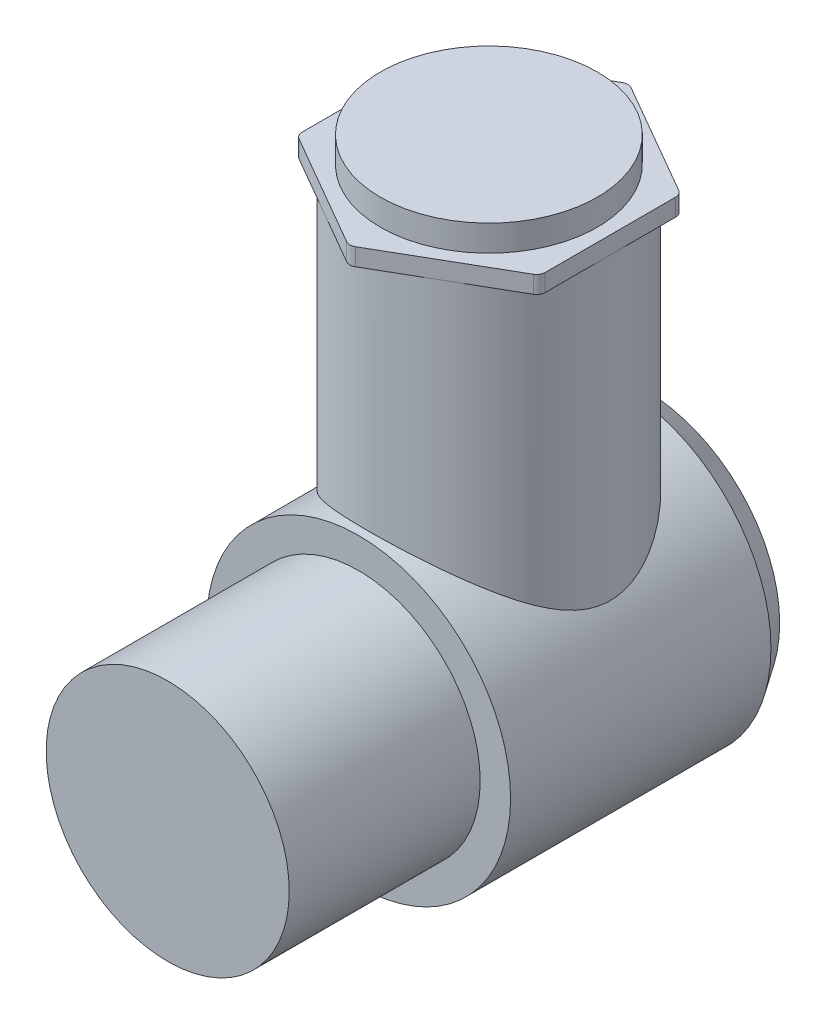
ISO-10303-21;
HEADER;
FILE_DESCRIPTION(('STEP AP214'),'2;1');
FILE_NAME('part.step','',(''),(''),'','','');
FILE_SCHEMA(('AUTOMOTIVE_DESIGN { 1 0 10303 214 1 1 1 1 }'));
ENDSEC;
DATA;
#1=APPLICATION_CONTEXT('core data for automotive mechanical design processes');
#2=APPLICATION_PROTOCOL_DEFINITION('international standard','automotive_design',2000,#1);
#3=PRODUCT_CONTEXT('',#1,'mechanical');
#4=PRODUCT('Part','Part','',(#3));
#5=PRODUCT_RELATED_PRODUCT_CATEGORY('part','',(#4));
#6=PRODUCT_DEFINITION_FORMATION('','',#4);
#7=PRODUCT_DEFINITION_CONTEXT('part definition',#1,'design');
#8=PRODUCT_DEFINITION('design','',#6,#7);
#9=PRODUCT_DEFINITION_SHAPE('','',#8);
#10=(LENGTH_UNIT() NAMED_UNIT(*) SI_UNIT(.MILLI.,.METRE.));
#11=(NAMED_UNIT(*) PLANE_ANGLE_UNIT() SI_UNIT($,.RADIAN.));
#12=(NAMED_UNIT(*) SI_UNIT($,.STERADIAN.) SOLID_ANGLE_UNIT());
#13=UNCERTAINTY_MEASURE_WITH_UNIT(LENGTH_MEASURE(1.E-05),#10,'distance_accuracy_value','');
#14=(GEOMETRIC_REPRESENTATION_CONTEXT(3) GLOBAL_UNCERTAINTY_ASSIGNED_CONTEXT((#13)) GLOBAL_UNIT_ASSIGNED_CONTEXT((#10,
#11,#12)) REPRESENTATION_CONTEXT('',''));
#15=CARTESIAN_POINT('',(0.,0.,0.));
#16=DIRECTION('',(0.,0.,1.));
#17=DIRECTION('',(1.,0.,0.));
#18=AXIS2_PLACEMENT_3D('',#15,#16,#17);
#19=CARTESIAN_POINT('',(0.,0.,150.));
#20=DIRECTION('',(0.,0.,-1.));
#21=DIRECTION('',(-1.,0.,0.));
#22=AXIS2_PLACEMENT_3D('',#19,#20,#21);
#23=CYLINDRICAL_SURFACE('',#22,175.);
#24=CARTESIAN_POINT('',(0.,0.,150.));
#25=DIRECTION('',(0.,0.,1.));
#26=DIRECTION('',(1.,0.,0.));
#27=AXIS2_PLACEMENT_3D('',#24,#25,#26);
#28=CIRCLE('',#27,175.);
#29=CARTESIAN_POINT('',(175.,0.,150.));
#30=VERTEX_POINT('',#29);
#31=EDGE_CURVE('E226',#30,#30,#28,.T.);
#32=ORIENTED_EDGE('',*,*,#31,.F.);
#33=EDGE_LOOP('',(#32));
#34=FACE_BOUND('',#33,.T.);
#35=CARTESIAN_POINT('',(0.,0.,-150.));
#36=DIRECTION('',(0.,0.,1.));
#37=DIRECTION('',(1.,0.,0.));
#38=AXIS2_PLACEMENT_3D('',#35,#36,#37);
#39=CIRCLE('',#38,175.);
#40=CARTESIAN_POINT('',(175.,0.,-150.));
#41=VERTEX_POINT('',#40);
#42=EDGE_CURVE('E199',#41,#41,#39,.T.);
#43=ORIENTED_EDGE('',*,*,#42,.T.);
#44=EDGE_LOOP('',(#43));
#45=FACE_BOUND('',#44,.T.);
#46=CARTESIAN_POINT('',(0.,175.,-140.));
#47=CARTESIAN_POINT('',(-1.68080300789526,174.999998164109,-139.999998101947));
#48=CARTESIAN_POINT('',(-3.36167422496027,174.975771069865,-139.969717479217));
#49=CARTESIAN_POINT('',(-6.72004292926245,174.878997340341,-139.848721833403));
#50=CARTESIAN_POINT('',(-8.39753991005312,174.806443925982,-139.757998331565));
#51=CARTESIAN_POINT('',(-11.7462356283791,174.61340139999,-139.51646936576));
#52=CARTESIAN_POINT('',(-13.4174310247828,174.492889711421,-139.365635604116));
#53=CARTESIAN_POINT('',(-16.7492251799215,174.204648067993,-139.004572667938));
#54=CARTESIAN_POINT('',(-18.4098243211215,174.036919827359,-138.794345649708));
#55=CARTESIAN_POINT('',(-21.7203796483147,173.654849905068,-138.314959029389));
#56=CARTESIAN_POINT('',(-23.3703092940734,173.440419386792,-138.04568710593));
#57=CARTESIAN_POINT('',(-26.6531920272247,172.966349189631,-137.449592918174));
#58=CARTESIAN_POINT('',(-28.2861449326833,172.706709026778,-137.122770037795));
#59=CARTESIAN_POINT('',(-31.53193351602,172.143689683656,-136.412963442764));
#60=CARTESIAN_POINT('',(-33.1447718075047,171.84031625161,-136.02998710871));
#61=CARTESIAN_POINT('',(-36.3478712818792,171.191420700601,-135.209339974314));
#62=CARTESIAN_POINT('',(-37.9381325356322,170.845898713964,-134.771669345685));
#63=CARTESIAN_POINT('',(-41.0834344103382,170.116844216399,-133.846260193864));
#64=CARTESIAN_POINT('',(-42.6386364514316,169.733572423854,-133.358864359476));
#65=CARTESIAN_POINT('',(-45.7223867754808,168.92898761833,-132.333306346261));
#66=CARTESIAN_POINT('',(-47.250932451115,168.507670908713,-131.79513923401));
#67=CARTESIAN_POINT('',(-50.2791715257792,167.62902571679,-130.669865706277));
#68=CARTESIAN_POINT('',(-51.7788679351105,167.171701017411,-130.082764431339));
#69=CARTESIAN_POINT('',(-54.7480602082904,166.222980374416,-128.861271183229));
#70=CARTESIAN_POINT('',(-56.2175534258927,165.731581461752,-128.226875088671));
#71=CARTESIAN_POINT('',(-59.1243339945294,164.71697581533,-126.912790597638));
#72=CARTESIAN_POINT('',(-60.561631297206,164.193779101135,-126.233116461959));
#73=CARTESIAN_POINT('',(-63.4034220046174,163.117487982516,-124.829954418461));
#74=CARTESIAN_POINT('',(-64.8079124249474,162.564390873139,-124.106462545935));
#75=CARTESIAN_POINT('',(-67.5830067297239,161.430430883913,-122.61735982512));
#76=CARTESIAN_POINT('',(-68.9536093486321,160.849566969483,-121.851747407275));
#77=CARTESIAN_POINT('',(-71.6600682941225,159.66220139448,-120.280021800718));
#78=CARTESIAN_POINT('',(-72.9959233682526,159.055698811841,-119.473907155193));
#79=CARTESIAN_POINT('',(-76.0913887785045,157.603787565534,-117.535094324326));
#80=CARTESIAN_POINT('',(-77.8365284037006,156.748747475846,-116.386443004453));
#81=CARTESIAN_POINT('',(-81.2611345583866,155.00104585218,-114.021746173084));
#82=CARTESIAN_POINT('',(-82.9405967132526,154.10838182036,-112.805696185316));
#83=CARTESIAN_POINT('',(-86.2333082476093,152.290361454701,-110.309049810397));
#84=CARTESIAN_POINT('',(-87.8465399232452,151.364996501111,-109.028436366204));
#85=CARTESIAN_POINT('',(-91.0056433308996,149.486954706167,-106.40576831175));
#86=CARTESIAN_POINT('',(-92.5515161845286,148.534278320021,-105.06371472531));
#87=CARTESIAN_POINT('',(-95.5794864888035,146.604207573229,-102.316915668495));
#88=CARTESIAN_POINT('',(-97.0614048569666,145.626754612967,-100.912014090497));
#89=CARTESIAN_POINT('',(-99.9567992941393,143.654816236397,-98.0448335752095));
#90=CARTESIAN_POINT('',(-101.370275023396,142.660330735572,-96.5825543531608));
#91=CARTESIAN_POINT('',(-104.128324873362,140.659851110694,-93.6024225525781));
#92=CARTESIAN_POINT('',(-105.472907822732,139.653858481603,-92.0845771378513));
#93=CARTESIAN_POINT('',(-108.093069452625,137.635833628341,-88.9943375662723));
#94=CARTESIAN_POINT('',(-109.368648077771,136.623801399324,-87.4219433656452));
#95=CARTESIAN_POINT('',(-111.869836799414,134.583745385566,-84.198375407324));
#96=CARTESIAN_POINT('',(-113.094352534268,133.555719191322,-82.5463538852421));
#97=CARTESIAN_POINT('',(-115.471235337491,131.506107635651,-79.1872914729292));
#98=CARTESIAN_POINT('',(-116.623601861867,130.484522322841,-77.4802501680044));
#99=CARTESIAN_POINT('',(-118.855725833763,128.454633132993,-74.0106281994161));
#100=CARTESIAN_POINT('',(-119.935458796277,127.446333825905,-72.2480290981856));
#101=CARTESIAN_POINT('',(-122.020717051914,125.451291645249,-68.6675802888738));
#102=CARTESIAN_POINT('',(-123.026243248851,124.464548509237,-66.8497312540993));
#103=CARTESIAN_POINT('',(-124.958865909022,122.52408614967,-63.1632898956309));
#104=CARTESIAN_POINT('',(-125.886169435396,121.570283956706,-61.2948500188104));
#105=CARTESIAN_POINT('',(-127.663361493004,119.702663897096,-57.5017634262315));
#106=CARTESIAN_POINT('',(-128.513246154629,118.788848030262,-55.5771139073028));
#107=CARTESIAN_POINT('',(-130.132278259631,117.012960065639,-51.6725606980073));
#108=CARTESIAN_POINT('',(-130.901482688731,116.150851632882,-49.6926972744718));
#109=CARTESIAN_POINT('',(-132.356330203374,114.490263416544,-45.676710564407));
#110=CARTESIAN_POINT('',(-133.04198830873,113.69177220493,-43.6405974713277));
#111=CARTESIAN_POINT('',(-134.422147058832,112.057997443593,-39.2028779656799));
#112=CARTESIAN_POINT('',(-135.10255475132,111.23515288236,-36.7922501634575));
#113=CARTESIAN_POINT('',(-136.340408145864,109.714429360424,-31.9006744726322));
#114=CARTESIAN_POINT('',(-136.897873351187,109.016530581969,-29.4197378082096));
#115=CARTESIAN_POINT('',(-137.635338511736,108.081775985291,-25.654366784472));
#116=CARTESIAN_POINT('',(-137.86453674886,107.789094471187,-24.3931132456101));
#117=CARTESIAN_POINT('',(-138.289361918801,107.243517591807,-21.8564732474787));
#118=CARTESIAN_POINT('',(-138.4849923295,106.990618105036,-20.5810882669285));
#119=CARTESIAN_POINT('',(-138.84176494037,106.5272258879,-18.0177420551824));
#120=CARTESIAN_POINT('',(-139.00290467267,106.316736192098,-16.7297799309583));
#121=CARTESIAN_POINT('',(-139.289832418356,105.940542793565,-14.1433877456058));
#122=CARTESIAN_POINT('',(-139.415620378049,105.774839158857,-12.8449576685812));
#123=CARTESIAN_POINT('',(-139.632092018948,105.4889159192,-10.2282810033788));
#124=CARTESIAN_POINT('',(-139.722450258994,105.369118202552,-8.90996117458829));
#125=CARTESIAN_POINT('',(-139.865885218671,105.178649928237,-6.26774170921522));
#126=CARTESIAN_POINT('',(-139.918961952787,105.107979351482,-4.94384207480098));
#127=CARTESIAN_POINT('',(-139.987491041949,105.016692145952,-2.2933930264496));
#128=CARTESIAN_POINT('',(-140.002944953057,104.996073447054,-0.966843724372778));
#129=CARTESIAN_POINT('',(-139.99613153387,105.005157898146,1.68598659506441));
#130=CARTESIAN_POINT('',(-139.973864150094,105.034861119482,3.01226761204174));
#131=CARTESIAN_POINT('',(-139.891724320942,105.144234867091,5.66254597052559));
#132=CARTESIAN_POINT('',(-139.83182491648,105.223941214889,6.98654099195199));
#133=CARTESIAN_POINT('',(-139.674780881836,105.432312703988,9.62843162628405));
#134=CARTESIAN_POINT('',(-139.577636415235,105.560977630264,10.9463272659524));
#135=CARTESIAN_POINT('',(-139.346685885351,105.86565841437,13.5735101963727));
#136=CARTESIAN_POINT('',(-139.212876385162,106.041678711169,14.882796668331));
#137=CARTESIAN_POINT('',(-138.909365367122,106.438952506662,17.4903193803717));
#138=CARTESIAN_POINT('',(-138.739662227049,106.660208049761,18.7885551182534));
#139=CARTESIAN_POINT('',(-138.335979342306,107.183405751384,21.5739331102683));
#140=CARTESIAN_POINT('',(-138.09609811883,107.492554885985,23.0588696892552));
#141=CARTESIAN_POINT('',(-137.571055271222,108.163700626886,26.0086403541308));
#142=CARTESIAN_POINT('',(-137.285891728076,108.525699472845,27.4734735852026));
#143=CARTESIAN_POINT('',(-136.671839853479,109.297993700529,30.3811831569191));
#144=CARTESIAN_POINT('',(-136.342947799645,109.708293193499,31.82405761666));
#145=CARTESIAN_POINT('',(-135.643011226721,110.572523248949,34.6863783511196));
#146=CARTESIAN_POINT('',(-135.271961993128,111.02645869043,36.1058219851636));
#147=CARTESIAN_POINT('',(-134.096026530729,112.448966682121,40.333948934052));
#148=CARTESIAN_POINT('',(-133.22970975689,113.476509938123,43.1060520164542));
#149=CARTESIAN_POINT('',(-131.344544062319,115.65328781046,48.5479943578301));
#150=CARTESIAN_POINT('',(-130.325682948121,116.802532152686,51.2178254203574));
#151=CARTESIAN_POINT('',(-128.42141115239,118.888175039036,55.7890107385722));
#152=CARTESIAN_POINT('',(-127.567981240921,119.804352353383,57.7130902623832));
#153=CARTESIAN_POINT('',(-125.783502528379,121.676548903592,61.505304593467));
#154=CARTESIAN_POINT('',(-124.852445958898,122.632572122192,63.3734337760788));
#155=CARTESIAN_POINT('',(-122.914525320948,124.574887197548,67.0548144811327));
#156=CARTESIAN_POINT('',(-121.907632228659,125.56119055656,68.8680446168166));
#157=CARTESIAN_POINT('',(-119.819938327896,127.554952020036,72.4393565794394));
#158=CARTESIAN_POINT('',(-118.739139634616,128.562409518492,74.1974399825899));
#159=CARTESIAN_POINT('',(-116.503454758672,130.591833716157,77.6607892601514));
#160=CARTESIAN_POINT('',(-115.348483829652,131.613815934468,79.3659912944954));
#161=CARTESIAN_POINT('',(-112.966394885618,133.663993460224,82.7213806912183));
#162=CARTESIAN_POINT('',(-111.739276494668,134.692188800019,84.3715677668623));
#163=CARTESIAN_POINT('',(-109.213677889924,136.748029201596,87.6161990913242));
#164=CARTESIAN_POINT('',(-107.91520968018,137.775674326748,89.2106526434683));
#165=CARTESIAN_POINT('',(-105.247124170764,139.824432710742,92.3432496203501));
#166=CARTESIAN_POINT('',(-103.877506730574,140.845545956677,93.8813929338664));
#167=CARTESIAN_POINT('',(-101.029751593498,142.902612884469,96.940562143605));
#168=CARTESIAN_POINT('',(-99.5496889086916,143.938230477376,98.4600235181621));
#169=CARTESIAN_POINT('',(-96.5151774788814,145.990326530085,101.436370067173));
#170=CARTESIAN_POINT('',(-94.9607282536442,147.006804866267,102.893254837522));
#171=CARTESIAN_POINT('',(-91.7775386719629,149.014849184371,105.742359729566));
#172=CARTESIAN_POINT('',(-90.1487848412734,150.006410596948,107.134568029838));
#173=CARTESIAN_POINT('',(-86.8178254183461,151.958519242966,109.851189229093));
#174=CARTESIAN_POINT('',(-85.1156216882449,152.919067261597,111.175603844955));
#175=CARTESIAN_POINT('',(-81.6424328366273,154.801181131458,113.75049796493));
#176=CARTESIAN_POINT('',(-79.8716114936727,155.722830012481,115.001137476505));
#177=CARTESIAN_POINT('',(-76.258671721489,157.523613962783,117.42806607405));
#178=CARTESIAN_POINT('',(-74.4165515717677,158.402748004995,118.604353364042));
#179=CARTESIAN_POINT('',(-70.6633639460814,160.112272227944,120.878042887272));
#180=CARTESIAN_POINT('',(-68.7523224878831,160.942680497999,121.975474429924));
#181=CARTESIAN_POINT('',(-64.8628910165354,162.549165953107,124.087474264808));
#182=CARTESIAN_POINT('',(-62.8845074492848,163.325248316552,125.102050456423));
#183=CARTESIAN_POINT('',(-59.4416008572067,164.602644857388,126.764452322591));
#184=CARTESIAN_POINT('',(-57.9929296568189,165.118790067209,127.433836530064));
#185=CARTESIAN_POINT('',(-55.0641143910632,166.118443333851,128.726474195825));
#186=CARTESIAN_POINT('',(-53.5839717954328,166.601952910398,129.349729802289));
#187=CARTESIAN_POINT('',(-50.5938587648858,167.534216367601,130.548287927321));
#188=CARTESIAN_POINT('',(-49.083892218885,167.982974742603,131.123596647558));
#189=CARTESIAN_POINT('',(-46.0356301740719,168.843800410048,132.224607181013));
#190=CARTESIAN_POINT('',(-44.4973343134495,169.255867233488,132.75030836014));
#191=CARTESIAN_POINT('',(-41.3952087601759,170.041157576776,133.750106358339));
#192=CARTESIAN_POINT('',(-39.8313929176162,170.41440140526,134.224230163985));
#193=CARTESIAN_POINT('',(-36.6796488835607,171.12045842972,135.119528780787));
#194=CARTESIAN_POINT('',(-35.0917207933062,171.453271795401,135.540703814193));
#195=CARTESIAN_POINT('',(-31.8941273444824,172.076779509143,136.328559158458));
#196=CARTESIAN_POINT('',(-30.2844610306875,172.367471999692,136.695237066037));
#197=CARTESIAN_POINT('',(-27.0461508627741,172.905175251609,137.372639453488));
#198=CARTESIAN_POINT('',(-25.4175069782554,173.152185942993,137.683363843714));
#199=CARTESIAN_POINT('',(-22.1354889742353,173.602356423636,138.249078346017));
#200=CARTESIAN_POINT('',(-20.4820295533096,173.805276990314,138.503764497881));
#201=CARTESIAN_POINT('',(-17.1620513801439,174.16443889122,138.954201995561));
#202=CARTESIAN_POINT('',(-15.495532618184,174.320680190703,139.149953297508));
#203=CARTESIAN_POINT('',(-12.1527672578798,174.585570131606,139.481652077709));
#204=CARTESIAN_POINT('',(-10.4765205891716,174.694218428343,139.617599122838));
#205=CARTESIAN_POINT('',(-7.11779098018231,174.863273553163,139.82906877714));
#206=CARTESIAN_POINT('',(-5.43530804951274,174.923680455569,139.904591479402));
#207=CARTESIAN_POINT('',(-2.06790525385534,174.995884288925,139.994857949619));
#208=CARTESIAN_POINT('',(-0.382985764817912,175.007688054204,140.0096102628));
#209=CARTESIAN_POINT('',(2.98593306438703,174.982632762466,139.978290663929));
#210=CARTESIAN_POINT('',(4.66993240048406,174.945773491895,139.932218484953));
#211=CARTESIAN_POINT('',(8.03332891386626,174.823617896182,139.779467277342));
#212=CARTESIAN_POINT('',(9.71272631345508,174.738323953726,139.672791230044));
#213=CARTESIAN_POINT('',(13.0634643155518,174.519811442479,139.399323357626));
#214=CARTESIAN_POINT('',(14.7348050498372,174.386593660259,139.232532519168));
#215=CARTESIAN_POINT('',(17.9307163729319,174.085761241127,138.855551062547));
#216=CARTESIAN_POINT('',(19.456182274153,173.921819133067,138.649985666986));
#217=CARTESIAN_POINT('',(22.4949334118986,173.554948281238,138.18950554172));
#218=CARTESIAN_POINT('',(24.0082186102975,173.35201941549,137.934590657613));
#219=CARTESIAN_POINT('',(27.0200742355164,172.908162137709,137.376348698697));
#220=CARTESIAN_POINT('',(28.518645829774,172.667236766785,137.073025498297));
#221=CARTESIAN_POINT('',(31.498964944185,172.148491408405,136.418997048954));
#222=CARTESIAN_POINT('',(32.9807123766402,171.870671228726,136.068291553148));
#223=CARTESIAN_POINT('',(35.9255061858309,171.279344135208,135.320604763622));
#224=CARTESIAN_POINT('',(37.3885498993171,170.965832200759,134.923616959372));
#225=CARTESIAN_POINT('',(40.2939365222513,170.304487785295,134.084619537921));
#226=CARTESIAN_POINT('',(41.7362778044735,169.956652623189,133.642606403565));
#227=CARTESIAN_POINT('',(44.598365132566,169.228148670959,132.714915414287));
#228=CARTESIAN_POINT('',(46.0181121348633,168.847481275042,132.229239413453));
#229=CARTESIAN_POINT('',(48.8336490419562,168.054794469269,131.21552406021));
#230=CARTESIAN_POINT('',(50.2294368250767,167.642772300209,130.687480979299));
#231=CARTESIAN_POINT('',(53.0808895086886,166.762646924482,129.556606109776));
#232=CARTESIAN_POINT('',(54.53493934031,166.292652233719,128.951170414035));
#233=CARTESIAN_POINT('',(57.4130042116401,165.32106571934,127.695781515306));
#234=CARTESIAN_POINT('',(58.8370165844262,164.819471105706,127.04582438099));
#235=CARTESIAN_POINT('',(63.061882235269,163.270307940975,125.031720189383));
#236=CARTESIAN_POINT('',(65.8161354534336,162.178182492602,123.603112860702));
#237=CARTESIAN_POINT('',(71.1910277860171,159.891743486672,120.587462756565));
#238=CARTESIAN_POINT('',(73.8116828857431,158.697442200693,119.000439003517));
#239=CARTESIAN_POINT('',(78.9151973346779,156.22238895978,115.679129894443));
#240=CARTESIAN_POINT('',(81.3980487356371,154.941632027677,113.944836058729));
#241=CARTESIAN_POINT('',(86.679082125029,152.060563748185,109.998021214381));
#242=CARTESIAN_POINT('',(89.4480661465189,150.445634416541,107.757096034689));
#243=CARTESIAN_POINT('',(94.7837127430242,147.142422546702,103.095107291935));
#244=CARTESIAN_POINT('',(97.3503521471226,145.454131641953,100.674023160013));
#245=CARTESIAN_POINT('',(101.04998778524,142.885144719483,96.9123528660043));
#246=CARTESIAN_POINT('',(102.259787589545,142.021447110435,95.6348447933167));
#247=CARTESIAN_POINT('',(104.627883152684,140.285994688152,93.0381307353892));
#248=CARTESIAN_POINT('',(105.786179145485,139.414239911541,91.7189249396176));
#249=CARTESIAN_POINT('',(108.051018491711,137.666349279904,89.039623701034));
#250=CARTESIAN_POINT('',(109.157561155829,136.790213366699,87.6795277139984));
#251=CARTESIAN_POINT('',(111.318646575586,135.037382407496,84.9189711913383));
#252=CARTESIAN_POINT('',(112.37318877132,134.160687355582,83.518510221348));
#253=CARTESIAN_POINT('',(114.649528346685,132.223938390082,80.3742176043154));
#254=CARTESIAN_POINT('',(115.858966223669,131.16469914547,78.6209125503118));
#255=CARTESIAN_POINT('',(118.199953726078,129.059092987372,75.0554421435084));
#256=CARTESIAN_POINT('',(119.331500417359,128.01272656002,73.2432745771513));
#257=CARTESIAN_POINT('',(121.516068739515,125.940907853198,69.5588557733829));
#258=CARTESIAN_POINT('',(122.569046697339,124.915467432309,67.686571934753));
#259=CARTESIAN_POINT('',(124.594080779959,122.895727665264,63.8823773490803));
#260=CARTESIAN_POINT('',(125.566138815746,121.901427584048,61.950468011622));
#261=CARTESIAN_POINT('',(127.423859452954,119.958161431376,58.0331176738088));
#262=CARTESIAN_POINT('',(128.309811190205,119.009049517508,56.0478865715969));
#263=CARTESIAN_POINT('',(129.996274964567,117.164543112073,52.0167508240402));
#264=CARTESIAN_POINT('',(130.79678110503,116.269152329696,49.9708420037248));
#265=CARTESIAN_POINT('',(132.307814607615,114.546730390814,45.8204505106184));
#266=CARTESIAN_POINT('',(133.01843406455,113.719629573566,43.7160305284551));
#267=CARTESIAN_POINT('',(134.345978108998,112.148188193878,39.4480909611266));
#268=CARTESIAN_POINT('',(134.962926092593,111.403826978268,37.2845862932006));
#269=CARTESIAN_POINT('',(136.141529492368,109.960982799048,32.7325797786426));
#270=CARTESIAN_POINT('',(136.695368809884,109.270339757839,30.3395098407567));
#271=CARTESIAN_POINT('',(137.434861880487,108.336587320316,26.7055796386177));
#272=CARTESIAN_POINT('',(137.666154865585,108.042363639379,25.4868400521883));
#273=CARTESIAN_POINT('',(138.097453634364,107.490539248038,23.035651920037));
#274=CARTESIAN_POINT('',(138.297462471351,107.232934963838,21.8032047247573));
#275=CARTESIAN_POINT('',(138.664944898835,106.757309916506,19.3285945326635));
#276=CARTESIAN_POINT('',(138.832485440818,106.539207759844,18.0864571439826));
#277=CARTESIAN_POINT('',(139.134734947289,106.144182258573,15.5917908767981));
#278=CARTESIAN_POINT('',(139.269447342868,105.967254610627,14.3392630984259));
#279=CARTESIAN_POINT('',(139.505369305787,105.656471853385,11.8256294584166));
#280=CARTESIAN_POINT('',(139.606576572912,105.522619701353,10.5645230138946));
#281=CARTESIAN_POINT('',(139.774914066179,105.299539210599,8.03608687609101));
#282=CARTESIAN_POINT('',(139.842044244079,105.210310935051,6.76875717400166));
#283=CARTESIAN_POINT('',(139.942109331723,105.077176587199,4.2233971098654));
#284=CARTESIAN_POINT('',(139.974855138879,105.033521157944,2.94534613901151));
#285=CARTESIAN_POINT('',(140.005301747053,104.992933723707,0.388083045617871));
#286=CARTESIAN_POINT('',(140.003002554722,104.996001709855,-0.891129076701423));
#287=CARTESIAN_POINT('',(139.963373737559,105.048822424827,-3.4480120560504));
#288=CARTESIAN_POINT('',(139.926044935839,105.098574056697,-4.72568294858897));
#289=CARTESIAN_POINT('',(139.816583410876,105.244150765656,-7.27689534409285));
#290=CARTESIAN_POINT('',(139.744450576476,105.339975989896,-8.5504368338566));
#291=CARTESIAN_POINT('',(139.56568201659,105.576713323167,-11.0926238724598));
#292=CARTESIAN_POINT('',(139.458999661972,105.717686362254,-12.3612604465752));
#293=CARTESIAN_POINT('',(139.211756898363,106.043049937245,-14.8896007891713));
#294=CARTESIAN_POINT('',(139.071196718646,106.227440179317,-16.1493046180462));
#295=CARTESIAN_POINT('',(138.756912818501,106.637638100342,-18.6579008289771));
#296=CARTESIAN_POINT('',(138.583185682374,106.863450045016,-19.90679208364));
#297=CARTESIAN_POINT('',(138.2034067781,107.354154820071,-22.3919340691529));
#298=CARTESIAN_POINT('',(137.997353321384,107.619049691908,-23.6281841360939));
#299=CARTESIAN_POINT('',(137.492993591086,108.263044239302,-26.4236469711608));
#300=CARTESIAN_POINT('',(137.184882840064,108.653544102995,-27.9784852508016));
#301=CARTESIAN_POINT('',(136.519551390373,109.488342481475,-31.0628789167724));
#302=CARTESIAN_POINT('',(136.162327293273,109.9326447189,-32.592432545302));
#303=CARTESIAN_POINT('',(135.019556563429,111.338112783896,-37.1415422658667));
#304=CARTESIAN_POINT('',(134.162920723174,112.371827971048,-40.1214965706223));
#305=CARTESIAN_POINT('',(132.745650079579,114.035635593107,-44.5080209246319));
#306=CARTESIAN_POINT('',(132.250446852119,114.609927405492,-45.9581167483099));
#307=CARTESIAN_POINT('',(131.217368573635,115.791266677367,-48.8295946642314));
#308=CARTESIAN_POINT('',(130.679494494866,116.398313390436,-50.2509774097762));
#309=CARTESIAN_POINT('',(129.562397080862,117.640482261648,-53.0648387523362));
#310=CARTESIAN_POINT('',(128.983173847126,118.275604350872,-54.4573174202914));
#311=CARTESIAN_POINT('',(127.784444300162,119.569703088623,-57.2135842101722));
#312=CARTESIAN_POINT('',(127.164936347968,120.228680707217,-58.577371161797));
#313=CARTESIAN_POINT('',(125.596376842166,121.870254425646,-61.8891323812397));
#314=CARTESIAN_POINT('',(124.625392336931,122.863960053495,-63.8212593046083));
#315=CARTESIAN_POINT('',(122.602486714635,124.882635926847,-67.6259765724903));
#316=CARTESIAN_POINT('',(121.550558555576,125.907608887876,-69.4985617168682));
#317=CARTESIAN_POINT('',(119.367109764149,127.979525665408,-73.1852744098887));
#318=CARTESIAN_POINT('',(118.235561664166,129.026476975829,-74.9993814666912));
#319=CARTESIAN_POINT('',(115.894449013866,131.133354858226,-78.5686428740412));
#320=CARTESIAN_POINT('',(114.684886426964,132.193281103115,-80.3237987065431));
#321=CARTESIAN_POINT('',(112.187372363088,134.319341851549,-83.7767137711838));
#322=CARTESIAN_POINT('',(110.899347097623,135.385481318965,-85.4744165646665));
#323=CARTESIAN_POINT('',(108.246531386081,137.515753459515,-88.8100748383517));
#324=CARTESIAN_POINT('',(106.881740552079,138.579886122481,-90.4480300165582));
#325=CARTESIAN_POINT('',(104.07602174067,140.699226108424,-93.6628673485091));
#326=CARTESIAN_POINT('',(102.635105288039,141.75443475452,-95.2397586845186));
#327=CARTESIAN_POINT('',(99.6772758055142,143.849662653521,-98.3311597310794));
#328=CARTESIAN_POINT('',(98.1603627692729,144.889681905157,-99.8456694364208));
#329=CARTESIAN_POINT('',(95.0302616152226,146.961964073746,-102.829892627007));
#330=CARTESIAN_POINT('',(93.4160640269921,147.993941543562,-104.298746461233));
#331=CARTESIAN_POINT('',(90.1104254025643,150.029593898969,-107.167628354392));
#332=CARTESIAN_POINT('',(88.4189839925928,151.033268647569,-108.567656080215));
#333=CARTESIAN_POINT('',(84.9591637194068,153.006231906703,-111.29597869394));
#334=CARTESIAN_POINT('',(83.1907693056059,153.975513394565,-112.624258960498));
#335=CARTESIAN_POINT('',(79.5783457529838,155.873183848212,-115.205096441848));
#336=CARTESIAN_POINT('',(77.7343173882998,156.801573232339,-116.457654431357));
#337=CARTESIAN_POINT('',(73.9764950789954,158.608999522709,-118.880037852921));
#338=CARTESIAN_POINT('',(72.062878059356,159.488148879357,-120.050053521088));
#339=CARTESIAN_POINT('',(68.1636053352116,161.193209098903,-122.306158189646));
#340=CARTESIAN_POINT('',(66.1779474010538,162.019118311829,-123.392244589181));
#341=CARTESIAN_POINT('',(62.1383276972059,163.61093795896,-125.475056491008));
#342=CARTESIAN_POINT('',(60.0844016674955,164.376879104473,-126.471827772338));
#343=CARTESIAN_POINT('',(55.9108094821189,165.842912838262,-128.371478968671));
#344=CARTESIAN_POINT('',(53.7911515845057,166.543013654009,-129.274370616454));
#345=CARTESIAN_POINT('',(50.1932664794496,167.654204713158,-130.702189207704));
#346=CARTESIAN_POINT('',(48.7317803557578,168.084977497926,-131.254212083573));
#347=CARTESIAN_POINT('',(45.7825203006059,168.912124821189,-132.311808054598));
#348=CARTESIAN_POINT('',(44.29474757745,169.308500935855,-132.817383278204));
#349=CARTESIAN_POINT('',(41.2947290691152,170.065100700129,-133.78051897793));
#350=CARTESIAN_POINT('',(39.7824842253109,170.425325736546,-134.23808129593));
#351=CARTESIAN_POINT('',(36.7354378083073,171.107992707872,-135.103723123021));
#352=CARTESIAN_POINT('',(35.2006360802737,171.430434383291,-135.511802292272));
#353=CARTESIAN_POINT('',(32.1141671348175,172.035309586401,-136.276198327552));
#354=CARTESIAN_POINT('',(30.5625454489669,172.317831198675,-136.632629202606));
#355=CARTESIAN_POINT('',(27.4414914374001,172.842322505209,-137.293513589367));
#356=CARTESIAN_POINT('',(25.8720594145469,173.084292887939,-137.597967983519));
#357=CARTESIAN_POINT('',(22.7185435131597,173.526372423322,-138.15364725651));
#358=CARTESIAN_POINT('',(21.1344651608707,173.726496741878,-138.404891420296));
#359=CARTESIAN_POINT('',(17.9540323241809,174.083924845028,-138.853272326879));
#360=CARTESIAN_POINT('',(16.3576793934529,174.241233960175,-139.050415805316));
#361=CARTESIAN_POINT('',(13.5343266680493,174.480162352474,-139.349679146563));
#362=CARTESIAN_POINT('',(12.3092898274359,174.570883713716,-139.463245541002));
#363=CARTESIAN_POINT('',(9.85529393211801,174.72659870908,-139.658110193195));
#364=CARTESIAN_POINT('',(8.6263358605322,174.791598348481,-139.739415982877));
#365=CARTESIAN_POINT('',(6.16534044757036,174.895699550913,-139.869608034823));
#366=CARTESIAN_POINT('',(4.93330250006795,174.934795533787,-139.918487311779));
#367=CARTESIAN_POINT('',(2.46752218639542,174.986949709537,-139.983688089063));
#368=CARTESIAN_POINT('',(1.2337794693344,175.00000134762,-140.00000139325));
#369=CARTESIAN_POINT('',(0.,175.,-140.));
#370=B_SPLINE_CURVE_WITH_KNOTS('',3,(#46,#47,#48,#49,#50,#51,#52,#53,#54,#55,#56,#57,#58,#59,
#60,#61,#62,#63,#64,#65,#66,#67,#68,#69,#70,#71,#72,#73,#74,#75,#76,#77,#78,#79,#80,#81,#82,#83,
#84,#85,#86,#87,#88,#89,#90,#91,#92,#93,#94,#95,#96,#97,#98,#99,#100,#101,#102,#103,#104,#105,
#106,#107,#108,#109,#110,#111,#112,#113,#114,#115,#116,#117,#118,#119,#120,#121,#122,#123,#124,
#125,#126,#127,#128,#129,#130,#131,#132,#133,#134,#135,#136,#137,#138,#139,#140,#141,#142,#143,
#144,#145,#146,#147,#148,#149,#150,#151,#152,#153,#154,#155,#156,#157,#158,#159,#160,#161,#162,
#163,#164,#165,#166,#167,#168,#169,#170,#171,#172,#173,#174,#175,#176,#177,#178,#179,#180,#181,
#182,#183,#184,#185,#186,#187,#188,#189,#190,#191,#192,#193,#194,#195,#196,#197,#198,#199,#200,
#201,#202,#203,#204,#205,#206,#207,#208,#209,#210,#211,#212,#213,#214,#215,#216,#217,#218,#219,
#220,#221,#222,#223,#224,#225,#226,#227,#228,#229,#230,#231,#232,#233,#234,#235,#236,#237,#238,
#239,#240,#241,#242,#243,#244,#245,#246,#247,#248,#249,#250,#251,#252,#253,#254,#255,#256,#257,
#258,#259,#260,#261,#262,#263,#264,#265,#266,#267,#268,#269,#270,#271,#272,#273,#274,#275,#276,
#277,#278,#279,#280,#281,#282,#283,#284,#285,#286,#287,#288,#289,#290,#291,#292,#293,#294,#295,
#296,#297,#298,#299,#300,#301,#302,#303,#304,#305,#306,#307,#308,#309,#310,#311,#312,#313,#314,
#315,#316,#317,#318,#319,#320,#321,#322,#323,#324,#325,#326,#327,#328,#329,#330,#331,#332,#333,
#334,#335,#336,#337,#338,#339,#340,#341,#342,#343,#344,#345,#346,#347,#348,#349,#350,#351,#352,
#353,#354,#355,#356,#357,#358,#359,#360,#361,#362,#363,#364,#365,#366,#367,#368,#369),
.UNSPECIFIED.,.T.,.F.,(4,2,2,2,2,2,2,2,2,2,2,2,2,2,2,2,2,2,2,2,2,2,2,2,2,2,2,2,2,2,2,2,2,2,2,2,
2,2,2,2,2,2,2,2,2,2,2,2,2,2,2,2,2,2,2,2,2,2,2,2,2,2,2,2,2,2,2,2,2,2,2,2,2,2,2,2,2,2,2,2,2,2,2,2,
2,2,2,2,2,2,2,2,2,2,2,2,2,2,2,2,2,2,2,2,2,2,2,2,2,2,2,2,2,2,2,2,2,2,2,2,2,2,2,2,2,2,2,2,2,2,2,2,
2,2,2,2,2,2,2,2,2,2,2,2,2,2,2,2,2,2,2,2,2,2,2,2,2,2,2,2,2,4),(0.,5.04208097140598,
10.0848693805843,15.1300345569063,20.1750165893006,25.2296802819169,30.2843980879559,
35.3384521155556,40.3924902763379,45.4137899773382,50.4355780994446,55.4568393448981,
60.4785386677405,65.4986637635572,70.5192437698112,75.5400109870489,80.5609589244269,
87.3307845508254,94.1010603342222,100.873134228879,107.645095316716,114.434928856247,
121.224796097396,128.013791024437,134.802791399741,141.698034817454,148.593330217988,
155.490938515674,162.388462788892,169.26711482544,176.146110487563,183.020214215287,
189.89308029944,197.796597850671,205.698860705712,209.642636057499,213.586002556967,
217.52965111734,221.473305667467,225.452380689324,229.431454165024,233.41036306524,
237.389277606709,241.37104584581,245.352796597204,249.334920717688,253.317224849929,
257.922261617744,262.527493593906,267.133117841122,271.739257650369,280.971710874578,
290.204902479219,297.08939751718,303.974582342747,310.862415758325,317.750052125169,
324.645703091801,331.541389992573,338.435920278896,345.330464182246,352.409852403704,
359.489286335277,366.57000917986,373.650552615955,380.715127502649,387.779872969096,
394.841978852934,401.903410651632,406.933990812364,411.964336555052,416.994030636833,
422.023789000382,427.050902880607,432.077995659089,437.105310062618,442.132632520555,
447.186586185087,452.240543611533,457.294537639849,462.348523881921,467.401799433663,
472.455097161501,477.508146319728,482.561112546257,487.203675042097,491.846252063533,
496.48845769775,501.130687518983,505.773571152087,510.41681774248,515.059867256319,
519.703325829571,524.6331153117,529.563340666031,539.421875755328,549.279228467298,
559.137149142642,570.859884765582,582.58396084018,588.463044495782,594.342101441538,
600.221236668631,606.100435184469,613.234844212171,620.369521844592,627.508136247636,
634.646582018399,641.760163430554,648.874235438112,655.980958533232,663.085903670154,
670.733222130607,674.557140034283,678.38068449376,682.196258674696,686.011433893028,
689.826870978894,693.642313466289,697.478631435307,701.314948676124,705.151175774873,
708.987415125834,712.828853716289,716.670266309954,720.51207472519,724.354083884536,
729.249383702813,734.145022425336,743.936457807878,748.844895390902,753.753221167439,
758.661534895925,763.570048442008,770.70680256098,777.844178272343,784.984028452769,
792.123699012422,799.270190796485,806.416718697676,813.562167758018,820.707617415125,
827.947761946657,835.187941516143,842.429591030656,849.671166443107,856.895466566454,
864.119990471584,871.340789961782,878.560685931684,883.421266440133,888.281624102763,
893.141795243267,898.00199976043,902.851306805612,907.70053151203,912.547995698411,
917.394856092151,921.095090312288,924.794460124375,928.494626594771,932.195724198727),.UNSPECIFIED.);
#371=CARTESIAN_POINT('',(0.,175.,-140.));
#372=VERTEX_POINT('',#371);
#373=EDGE_CURVE('E231',#372,#372,#370,.T.);
#374=ORIENTED_EDGE('',*,*,#373,.F.);
#375=EDGE_LOOP('',(#374));
#376=FACE_BOUND('',#375,.T.);
#377=ADVANCED_FACE('F47',(#34,#45,#376),#23,.T.);
#378=CARTESIAN_POINT('',(0.,0.,150.));
#379=DIRECTION('',(0.,0.,1.));
#380=DIRECTION('',(1.,0.,0.));
#381=AXIS2_PLACEMENT_3D('',#378,#379,#380);
#382=PLANE('',#381);
#383=CARTESIAN_POINT('',(0.,0.,150.));
#384=DIRECTION('',(0.,0.,1.));
#385=DIRECTION('',(1.,0.,0.));
#386=AXIS2_PLACEMENT_3D('',#383,#384,#385);
#387=CIRCLE('',#386,140.);
#388=CARTESIAN_POINT('',(140.,0.,150.));
#389=VERTEX_POINT('',#388);
#390=EDGE_CURVE('E227',#389,#389,#387,.T.);
#391=ORIENTED_EDGE('',*,*,#390,.F.);
#392=EDGE_LOOP('',(#391));
#393=FACE_BOUND('',#392,.T.);
#394=ORIENTED_EDGE('',*,*,#31,.T.);
#395=EDGE_LOOP('',(#394));
#396=FACE_BOUND('',#395,.T.);
#397=ADVANCED_FACE('F260',(#393,#396),#382,.T.);
#398=CARTESIAN_POINT('',(0.,0.,370.));
#399=DIRECTION('',(0.,0.,-1.));
#400=DIRECTION('',(-1.,0.,0.));
#401=AXIS2_PLACEMENT_3D('',#398,#399,#400);
#402=CYLINDRICAL_SURFACE('',#401,140.);
#403=CARTESIAN_POINT('',(0.,0.,370.));
#404=DIRECTION('',(0.,0.,1.));
#405=DIRECTION('',(1.,0.,0.));
#406=AXIS2_PLACEMENT_3D('',#403,#404,#405);
#407=CIRCLE('',#406,140.);
#408=CARTESIAN_POINT('',(140.,0.,370.));
#409=VERTEX_POINT('',#408);
#410=EDGE_CURVE('E185',#409,#409,#407,.T.);
#411=ORIENTED_EDGE('',*,*,#410,.F.);
#412=EDGE_LOOP('',(#411));
#413=FACE_BOUND('',#412,.T.);
#414=ORIENTED_EDGE('',*,*,#390,.T.);
#415=EDGE_LOOP('',(#414));
#416=FACE_BOUND('',#415,.T.);
#417=ADVANCED_FACE('F257',(#413,#416),#402,.T.);
#418=CARTESIAN_POINT('',(0.,0.,370.));
#419=DIRECTION('',(0.,0.,1.));
#420=DIRECTION('',(1.,0.,0.));
#421=AXIS2_PLACEMENT_3D('',#418,#419,#420);
#422=PLANE('',#421);
#423=ORIENTED_EDGE('',*,*,#410,.T.);
#424=EDGE_LOOP('',(#423));
#425=FACE_BOUND('',#424,.T.);
#426=ADVANCED_FACE('F253',(#425),#422,.T.);
#427=CARTESIAN_POINT('',(0.,450.,0.));
#428=DIRECTION('',(0.,-1.,0.));
#429=DIRECTION('',(0.,0.,-1.));
#430=AXIS2_PLACEMENT_3D('',#427,#428,#429);
#431=CYLINDRICAL_SURFACE('',#430,140.);
#432=CARTESIAN_POINT('',(0.,450.,0.));
#433=DIRECTION('',(0.,1.,0.));
#434=DIRECTION('',(0.,0.,1.));
#435=AXIS2_PLACEMENT_3D('',#432,#433,#434);
#436=CIRCLE('',#435,140.);
#437=CARTESIAN_POINT('',(70.,450.,121.243556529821));
#438=VERTEX_POINT('',#437);
#439=CARTESIAN_POINT('',(140.,450.,0.));
#440=VERTEX_POINT('',#439);
#441=EDGE_CURVE('E173',#438,#440,#436,.T.);
#442=ORIENTED_EDGE('',*,*,#441,.F.);
#443=CARTESIAN_POINT('',(-70.,450.,121.243556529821));
#444=VERTEX_POINT('',#443);
#445=EDGE_CURVE('E177',#444,#438,#436,.T.);
#446=ORIENTED_EDGE('',*,*,#445,.F.);
#447=CARTESIAN_POINT('',(-140.,450.,0.));
#448=VERTEX_POINT('',#447);
#449=EDGE_CURVE('E192',#448,#444,#436,.T.);
#450=ORIENTED_EDGE('',*,*,#449,.F.);
#451=CARTESIAN_POINT('',(-70.,450.,-121.243556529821));
#452=VERTEX_POINT('',#451);
#453=EDGE_CURVE('E495',#452,#448,#436,.T.);
#454=ORIENTED_EDGE('',*,*,#453,.F.);
#455=CARTESIAN_POINT('',(70.,450.,-121.243556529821));
#456=VERTEX_POINT('',#455);
#457=EDGE_CURVE('E497',#456,#452,#436,.T.);
#458=ORIENTED_EDGE('',*,*,#457,.F.);
#459=EDGE_CURVE('E181',#440,#456,#436,.T.);
#460=ORIENTED_EDGE('',*,*,#459,.F.);
#461=EDGE_LOOP('',(#442,#446,#450,#454,#458,#460));
#462=FACE_BOUND('',#461,.T.);
#463=ORIENTED_EDGE('',*,*,#373,.T.);
#464=EDGE_LOOP('',(#463));
#465=FACE_BOUND('',#464,.T.);
#466=ADVANCED_FACE('F174',(#462,#465),#431,.T.);
#467=CARTESIAN_POINT('',(0.,450.,0.));
#468=DIRECTION('',(0.,1.,0.));
#469=DIRECTION('',(0.,0.,1.));
#470=AXIS2_PLACEMENT_3D('',#467,#468,#469);
#471=PLANE('',#470);
#472=DIRECTION('',(0.,0.,-1.));
#473=VECTOR('',#472,1.);
#474=CARTESIAN_POINT('',(140.,450.,80.8290376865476));
#475=LINE('',#474,#473);
#476=CARTESIAN_POINT('',(140.,450.,75.0555349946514));
#477=VERTEX_POINT('',#476);
#478=EDGE_CURVE('E204',#477,#440,#475,.T.);
#479=ORIENTED_EDGE('',*,*,#478,.F.);
#480=CARTESIAN_POINT('',(130.,450.,75.0555349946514));
#481=DIRECTION('',(0.,1.,0.));
#482=DIRECTION('',(0.,0.,1.));
#483=AXIS2_PLACEMENT_3D('',#480,#481,#482);
#484=CIRCLE('',#483,10.);
#485=CARTESIAN_POINT('',(135.,450.,83.7157890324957));
#486=VERTEX_POINT('',#485);
#487=EDGE_CURVE('E56',#477,#486,#484,.F.);
#488=ORIENTED_EDGE('',*,*,#487,.T.);
#489=DIRECTION('',(0.866025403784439,0.,-0.5));
#490=VECTOR('',#489,1.);
#491=CARTESIAN_POINT('',(0.,450.,161.658075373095));
#492=LINE('',#491,#490);
#493=EDGE_CURVE('E161',#438,#486,#492,.T.);
#494=ORIENTED_EDGE('',*,*,#493,.F.);
#495=ORIENTED_EDGE('',*,*,#441,.T.);
#496=EDGE_LOOP('',(#479,#488,#494,#495));
#497=FACE_BOUND('',#496,.T.);
#498=ADVANCED_FACE('F194',(#497),#471,.F.);
#499=DIRECTION('',(-0.866025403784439,0.,-0.5));
#500=VECTOR('',#499,1.);
#501=CARTESIAN_POINT('',(140.,450.,-80.8290376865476));
#502=LINE('',#501,#500);
#503=CARTESIAN_POINT('',(135.,450.,-83.7157890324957));
#504=VERTEX_POINT('',#503);
#505=EDGE_CURVE('E208',#504,#456,#502,.T.);
#506=ORIENTED_EDGE('',*,*,#505,.F.);
#507=CARTESIAN_POINT('',(130.,450.,-75.0555349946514));
#508=DIRECTION('',(0.,1.,0.));
#509=DIRECTION('',(0.,0.,1.));
#510=AXIS2_PLACEMENT_3D('',#507,#508,#509);
#511=CIRCLE('',#510,10.);
#512=CARTESIAN_POINT('',(140.,450.,-75.0555349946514));
#513=VERTEX_POINT('',#512);
#514=EDGE_CURVE('E70',#504,#513,#511,.F.);
#515=ORIENTED_EDGE('',*,*,#514,.T.);
#516=EDGE_CURVE('E167',#440,#513,#475,.T.);
#517=ORIENTED_EDGE('',*,*,#516,.F.);
#518=ORIENTED_EDGE('',*,*,#459,.T.);
#519=EDGE_LOOP('',(#506,#515,#517,#518));
#520=FACE_BOUND('',#519,.T.);
#521=ADVANCED_FACE('F437',(#520),#471,.F.);
#522=DIRECTION('',(-0.866025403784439,0.,0.5));
#523=VECTOR('',#522,1.);
#524=CARTESIAN_POINT('',(0.,450.,-161.658075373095));
#525=LINE('',#524,#523);
#526=CARTESIAN_POINT('',(-4.99999999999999,450.,-158.771324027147));
#527=VERTEX_POINT('',#526);
#528=EDGE_CURVE('E212',#527,#452,#525,.T.);
#529=ORIENTED_EDGE('',*,*,#528,.F.);
#530=CARTESIAN_POINT('',(0.,450.,-150.111069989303));
#531=DIRECTION('',(0.,1.,0.));
#532=DIRECTION('',(0.,0.,1.));
#533=AXIS2_PLACEMENT_3D('',#530,#531,#532);
#534=CIRCLE('',#533,10.);
#535=CARTESIAN_POINT('',(4.99999999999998,450.,-158.771324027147));
#536=VERTEX_POINT('',#535);
#537=EDGE_CURVE('E345',#527,#536,#534,.F.);
#538=ORIENTED_EDGE('',*,*,#537,.T.);
#539=EDGE_CURVE('E207',#456,#536,#502,.T.);
#540=ORIENTED_EDGE('',*,*,#539,.F.);
#541=ORIENTED_EDGE('',*,*,#457,.T.);
#542=EDGE_LOOP('',(#529,#538,#540,#541));
#543=FACE_BOUND('',#542,.T.);
#544=ADVANCED_FACE('F467',(#543),#471,.F.);
#545=DIRECTION('',(0.,0.,1.));
#546=VECTOR('',#545,1.);
#547=CARTESIAN_POINT('',(-140.,450.,-80.8290376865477));
#548=LINE('',#547,#546);
#549=CARTESIAN_POINT('',(-140.,450.,-75.0555349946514));
#550=VERTEX_POINT('',#549);
#551=EDGE_CURVE('E216',#550,#448,#548,.T.);
#552=ORIENTED_EDGE('',*,*,#551,.F.);
#553=CARTESIAN_POINT('',(-130.,450.,-75.0555349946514));
#554=DIRECTION('',(0.,1.,0.));
#555=DIRECTION('',(0.,0.,1.));
#556=AXIS2_PLACEMENT_3D('',#553,#554,#555);
#557=CIRCLE('',#556,10.);
#558=CARTESIAN_POINT('',(-135.,450.,-83.7157890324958));
#559=VERTEX_POINT('',#558);
#560=EDGE_CURVE('E12',#550,#559,#557,.F.);
#561=ORIENTED_EDGE('',*,*,#560,.T.);
#562=EDGE_CURVE('E211',#452,#559,#525,.T.);
#563=ORIENTED_EDGE('',*,*,#562,.F.);
#564=ORIENTED_EDGE('',*,*,#453,.T.);
#565=EDGE_LOOP('',(#552,#561,#563,#564));
#566=FACE_BOUND('',#565,.T.);
#567=ADVANCED_FACE('F462',(#566),#471,.F.);
#568=DIRECTION('',(0.866025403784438,0.,0.5));
#569=VECTOR('',#568,1.);
#570=CARTESIAN_POINT('',(-140.,450.,80.8290376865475));
#571=LINE('',#570,#569);
#572=CARTESIAN_POINT('',(-135.,450.,83.7157890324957));
#573=VERTEX_POINT('',#572);
#574=EDGE_CURVE('E219',#573,#444,#571,.T.);
#575=ORIENTED_EDGE('',*,*,#574,.F.);
#576=CARTESIAN_POINT('',(-130.,450.,75.0555349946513));
#577=DIRECTION('',(0.,1.,0.));
#578=DIRECTION('',(0.,0.,1.));
#579=AXIS2_PLACEMENT_3D('',#576,#577,#578);
#580=CIRCLE('',#579,10.);
#581=CARTESIAN_POINT('',(-140.,450.,75.0555349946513));
#582=VERTEX_POINT('',#581);
#583=EDGE_CURVE('E322',#573,#582,#580,.F.);
#584=ORIENTED_EDGE('',*,*,#583,.T.);
#585=EDGE_CURVE('E215',#448,#582,#548,.T.);
#586=ORIENTED_EDGE('',*,*,#585,.F.);
#587=ORIENTED_EDGE('',*,*,#449,.T.);
#588=EDGE_LOOP('',(#575,#584,#586,#587));
#589=FACE_BOUND('',#588,.T.);
#590=ADVANCED_FACE('F458',(#589),#471,.F.);
#591=CARTESIAN_POINT('',(4.99999999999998,450.,158.771324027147));
#592=VERTEX_POINT('',#591);
#593=EDGE_CURVE('E156',#592,#438,#492,.T.);
#594=ORIENTED_EDGE('',*,*,#593,.F.);
#595=CARTESIAN_POINT('',(0.,450.,150.111069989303));
#596=DIRECTION('',(0.,1.,0.));
#597=DIRECTION('',(0.,0.,1.));
#598=AXIS2_PLACEMENT_3D('',#595,#596,#597);
#599=CIRCLE('',#598,10.);
#600=CARTESIAN_POINT('',(-5.00000000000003,450.,158.771324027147));
#601=VERTEX_POINT('',#600);
#602=EDGE_CURVE('E389',#592,#601,#599,.F.);
#603=ORIENTED_EDGE('',*,*,#602,.T.);
#604=EDGE_CURVE('E190',#444,#601,#571,.T.);
#605=ORIENTED_EDGE('',*,*,#604,.F.);
#606=ORIENTED_EDGE('',*,*,#445,.T.);
#607=EDGE_LOOP('',(#594,#603,#605,#606));
#608=FACE_BOUND('',#607,.T.);
#609=ADVANCED_FACE('F188',(#608),#471,.F.);
#610=CARTESIAN_POINT('',(0.,470.,161.658075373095));
#611=DIRECTION('',(-0.5,0.,-0.866025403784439));
#612=DIRECTION('',(-0.866025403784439,0.,0.5));
#613=AXIS2_PLACEMENT_3D('',#610,#611,#612);
#614=PLANE('',#613);
#615=DIRECTION('',(0.866025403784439,0.,-0.5));
#616=VECTOR('',#615,1.);
#617=CARTESIAN_POINT('',(0.,470.,161.658075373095));
#618=LINE('',#617,#616);
#619=CARTESIAN_POINT('',(4.99999999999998,470.,158.771324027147));
#620=VERTEX_POINT('',#619);
#621=CARTESIAN_POINT('',(135.,470.,83.7157890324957));
#622=VERTEX_POINT('',#621);
#623=EDGE_CURVE('E221',#620,#622,#618,.T.);
#624=ORIENTED_EDGE('',*,*,#623,.F.);
#625=DIRECTION('',(0.,-1.,0.));
#626=VECTOR('',#625,1.);
#627=CARTESIAN_POINT('',(4.99999999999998,470.,158.771324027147));
#628=LINE('',#627,#626);
#629=EDGE_CURVE('E163',#620,#592,#628,.T.);
#630=ORIENTED_EDGE('',*,*,#629,.T.);
#631=ORIENTED_EDGE('',*,*,#593,.T.);
#632=ORIENTED_EDGE('',*,*,#493,.T.);
#633=DIRECTION('',(0.,-1.,0.));
#634=VECTOR('',#633,1.);
#635=CARTESIAN_POINT('',(135.,470.,83.7157890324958));
#636=LINE('',#635,#634);
#637=EDGE_CURVE('E244',#486,#622,#636,.F.);
#638=ORIENTED_EDGE('',*,*,#637,.T.);
#639=EDGE_LOOP('',(#624,#630,#631,#632,#638));
#640=FACE_BOUND('',#639,.T.);
#641=ADVANCED_FACE('F159',(#640),#614,.F.);
#642=CARTESIAN_POINT('',(140.,470.,80.8290376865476));
#643=DIRECTION('',(-1.,0.,0.));
#644=DIRECTION('',(0.,0.,1.));
#645=AXIS2_PLACEMENT_3D('',#642,#643,#644);
#646=PLANE('',#645);
#647=ORIENTED_EDGE('',*,*,#516,.T.);
#648=DIRECTION('',(0.,-1.,0.));
#649=VECTOR('',#648,1.);
#650=CARTESIAN_POINT('',(140.,470.,-75.0555349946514));
#651=LINE('',#650,#649);
#652=CARTESIAN_POINT('',(140.,470.,-75.0555349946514));
#653=VERTEX_POINT('',#652);
#654=EDGE_CURVE('E360',#513,#653,#651,.F.);
#655=ORIENTED_EDGE('',*,*,#654,.T.);
#656=DIRECTION('',(0.,0.,-1.));
#657=VECTOR('',#656,1.);
#658=CARTESIAN_POINT('',(140.,470.,80.8290376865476));
#659=LINE('',#658,#657);
#660=CARTESIAN_POINT('',(140.,470.,75.0555349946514));
#661=VERTEX_POINT('',#660);
#662=EDGE_CURVE('E290',#661,#653,#659,.T.);
#663=ORIENTED_EDGE('',*,*,#662,.F.);
#664=DIRECTION('',(0.,-1.,0.));
#665=VECTOR('',#664,1.);
#666=CARTESIAN_POINT('',(140.,470.,75.0555349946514));
#667=LINE('',#666,#665);
#668=EDGE_CURVE('E357',#661,#477,#667,.T.);
#669=ORIENTED_EDGE('',*,*,#668,.T.);
#670=ORIENTED_EDGE('',*,*,#478,.T.);
#671=EDGE_LOOP('',(#647,#655,#663,#669,#670));
#672=FACE_BOUND('',#671,.T.);
#673=ADVANCED_FACE('F366',(#672),#646,.F.);
#674=CARTESIAN_POINT('',(140.,470.,-80.8290376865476));
#675=DIRECTION('',(-0.5,0.,0.866025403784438));
#676=DIRECTION('',(0.866025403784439,0.,0.5));
#677=AXIS2_PLACEMENT_3D('',#674,#675,#676);
#678=PLANE('',#677);
#679=ORIENTED_EDGE('',*,*,#539,.T.);
#680=DIRECTION('',(0.,-1.,0.));
#681=VECTOR('',#680,1.);
#682=CARTESIAN_POINT('',(5.00000000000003,470.,-158.771324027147));
#683=LINE('',#682,#681);
#684=CARTESIAN_POINT('',(4.99999999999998,470.,-158.771324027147));
#685=VERTEX_POINT('',#684);
#686=EDGE_CURVE('E352',#536,#685,#683,.F.);
#687=ORIENTED_EDGE('',*,*,#686,.T.);
#688=DIRECTION('',(-0.866025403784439,0.,-0.5));
#689=VECTOR('',#688,1.);
#690=CARTESIAN_POINT('',(140.,470.,-80.8290376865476));
#691=LINE('',#690,#689);
#692=CARTESIAN_POINT('',(135.,470.,-83.7157890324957));
#693=VERTEX_POINT('',#692);
#694=EDGE_CURVE('E294',#693,#685,#691,.T.);
#695=ORIENTED_EDGE('',*,*,#694,.F.);
#696=DIRECTION('',(0.,-1.,0.));
#697=VECTOR('',#696,1.);
#698=CARTESIAN_POINT('',(135.,470.,-83.7157890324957));
#699=LINE('',#698,#697);
#700=EDGE_CURVE('E348',#693,#504,#699,.T.);
#701=ORIENTED_EDGE('',*,*,#700,.T.);
#702=ORIENTED_EDGE('',*,*,#505,.T.);
#703=EDGE_LOOP('',(#679,#687,#695,#701,#702));
#704=FACE_BOUND('',#703,.T.);
#705=ADVANCED_FACE('F447',(#704),#678,.F.);
#706=CARTESIAN_POINT('',(0.,470.,-161.658075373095));
#707=DIRECTION('',(0.5,0.,0.866025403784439));
#708=DIRECTION('',(0.866025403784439,0.,-0.5));
#709=AXIS2_PLACEMENT_3D('',#706,#707,#708);
#710=PLANE('',#709);
#711=DIRECTION('',(-0.866025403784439,0.,0.5));
#712=VECTOR('',#711,1.);
#713=CARTESIAN_POINT('',(0.,470.,-161.658075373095));
#714=LINE('',#713,#712);
#715=CARTESIAN_POINT('',(-4.99999999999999,470.,-158.771324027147));
#716=VERTEX_POINT('',#715);
#717=CARTESIAN_POINT('',(-135.,470.,-83.7157890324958));
#718=VERTEX_POINT('',#717);
#719=EDGE_CURVE('E298',#716,#718,#714,.T.);
#720=ORIENTED_EDGE('',*,*,#719,.F.);
#721=DIRECTION('',(0.,-1.,0.));
#722=VECTOR('',#721,1.);
#723=CARTESIAN_POINT('',(-4.99999999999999,470.,-158.771324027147));
#724=LINE('',#723,#722);
#725=EDGE_CURVE('E341',#716,#527,#724,.T.);
#726=ORIENTED_EDGE('',*,*,#725,.T.);
#727=ORIENTED_EDGE('',*,*,#528,.T.);
#728=ORIENTED_EDGE('',*,*,#562,.T.);
#729=DIRECTION('',(0.,-1.,0.));
#730=VECTOR('',#729,1.);
#731=CARTESIAN_POINT('',(-135.,470.,-83.7157890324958));
#732=LINE('',#731,#730);
#733=EDGE_CURVE('E338',#559,#718,#732,.F.);
#734=ORIENTED_EDGE('',*,*,#733,.T.);
#735=EDGE_LOOP('',(#720,#726,#727,#728,#734));
#736=FACE_BOUND('',#735,.T.);
#737=ADVANCED_FACE('F443',(#736),#710,.F.);
#738=CARTESIAN_POINT('',(-140.,470.,-80.8290376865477));
#739=DIRECTION('',(1.,0.,0.));
#740=DIRECTION('',(0.,0.,-1.));
#741=AXIS2_PLACEMENT_3D('',#738,#739,#740);
#742=PLANE('',#741);
#743=ORIENTED_EDGE('',*,*,#585,.T.);
#744=DIRECTION('',(0.,-1.,0.));
#745=VECTOR('',#744,1.);
#746=CARTESIAN_POINT('',(-140.,470.,75.0555349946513));
#747=LINE('',#746,#745);
#748=CARTESIAN_POINT('',(-140.,470.,75.0555349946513));
#749=VERTEX_POINT('',#748);
#750=EDGE_CURVE('E335',#582,#749,#747,.F.);
#751=ORIENTED_EDGE('',*,*,#750,.T.);
#752=DIRECTION('',(0.,0.,1.));
#753=VECTOR('',#752,1.);
#754=CARTESIAN_POINT('',(-140.,470.,-80.8290376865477));
#755=LINE('',#754,#753);
#756=CARTESIAN_POINT('',(-140.,470.,-75.0555349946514));
#757=VERTEX_POINT('',#756);
#758=EDGE_CURVE('E301',#757,#749,#755,.T.);
#759=ORIENTED_EDGE('',*,*,#758,.F.);
#760=DIRECTION('',(0.,-1.,0.));
#761=VECTOR('',#760,1.);
#762=CARTESIAN_POINT('',(-140.,470.,-75.0555349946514));
#763=LINE('',#762,#761);
#764=EDGE_CURVE('E326',#757,#550,#763,.T.);
#765=ORIENTED_EDGE('',*,*,#764,.T.);
#766=ORIENTED_EDGE('',*,*,#551,.T.);
#767=EDGE_LOOP('',(#743,#751,#759,#765,#766));
#768=FACE_BOUND('',#767,.T.);
#769=ADVANCED_FACE('F440',(#768),#742,.F.);
#770=CARTESIAN_POINT('',(-140.,470.,80.8290376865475));
#771=DIRECTION('',(0.5,0.,-0.866025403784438));
#772=DIRECTION('',(-0.866025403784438,0.,-0.5));
#773=AXIS2_PLACEMENT_3D('',#770,#771,#772);
#774=PLANE('',#773);
#775=ORIENTED_EDGE('',*,*,#604,.T.);
#776=DIRECTION('',(0.,-1.,0.));
#777=VECTOR('',#776,1.);
#778=CARTESIAN_POINT('',(-5.00000000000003,470.,158.771324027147));
#779=LINE('',#778,#777);
#780=CARTESIAN_POINT('',(-5.00000000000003,470.,158.771324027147));
#781=VERTEX_POINT('',#780);
#782=EDGE_CURVE('E320',#601,#781,#779,.F.);
#783=ORIENTED_EDGE('',*,*,#782,.T.);
#784=DIRECTION('',(0.866025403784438,0.,0.5));
#785=VECTOR('',#784,1.);
#786=CARTESIAN_POINT('',(-140.,470.,80.8290376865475));
#787=LINE('',#786,#785);
#788=CARTESIAN_POINT('',(-135.,470.,83.7157890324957));
#789=VERTEX_POINT('',#788);
#790=EDGE_CURVE('E193',#789,#781,#787,.T.);
#791=ORIENTED_EDGE('',*,*,#790,.F.);
#792=DIRECTION('',(0.,-1.,0.));
#793=VECTOR('',#792,1.);
#794=CARTESIAN_POINT('',(-135.,470.,83.7157890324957));
#795=LINE('',#794,#793);
#796=EDGE_CURVE('E386',#789,#573,#795,.T.);
#797=ORIENTED_EDGE('',*,*,#796,.T.);
#798=ORIENTED_EDGE('',*,*,#574,.T.);
#799=EDGE_LOOP('',(#775,#783,#791,#797,#798));
#800=FACE_BOUND('',#799,.T.);
#801=ADVANCED_FACE('F433',(#800),#774,.F.);
#802=CARTESIAN_POINT('',(0.,470.,0.));
#803=DIRECTION('',(0.,1.,0.));
#804=DIRECTION('',(0.,0.,1.));
#805=AXIS2_PLACEMENT_3D('',#802,#803,#804);
#806=PLANE('',#805);
#807=CARTESIAN_POINT('',(0.,470.,0.));
#808=DIRECTION('',(0.,1.,0.));
#809=DIRECTION('',(0.,0.,1.));
#810=AXIS2_PLACEMENT_3D('',#807,#808,#809);
#811=CIRCLE('',#810,125.);
#812=CARTESIAN_POINT('',(0.,470.,125.));
#813=VERTEX_POINT('',#812);
#814=EDGE_CURVE('E243',#813,#813,#811,.T.);
#815=ORIENTED_EDGE('',*,*,#814,.F.);
#816=EDGE_LOOP('',(#815));
#817=FACE_BOUND('',#816,.T.);
#818=ORIENTED_EDGE('',*,*,#790,.T.);
#819=CARTESIAN_POINT('',(0.,470.,150.111069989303));
#820=DIRECTION('',(0.,1.,0.));
#821=DIRECTION('',(0.,0.,1.));
#822=AXIS2_PLACEMENT_3D('',#819,#820,#821);
#823=CIRCLE('',#822,10.);
#824=EDGE_CURVE('E312',#781,#620,#823,.T.);
#825=ORIENTED_EDGE('',*,*,#824,.T.);
#826=ORIENTED_EDGE('',*,*,#623,.T.);
#827=CARTESIAN_POINT('',(130.,470.,75.0555349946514));
#828=DIRECTION('',(0.,1.,0.));
#829=DIRECTION('',(0.,0.,1.));
#830=AXIS2_PLACEMENT_3D('',#827,#828,#829);
#831=CIRCLE('',#830,10.);
#832=EDGE_CURVE('E372',#622,#661,#831,.T.);
#833=ORIENTED_EDGE('',*,*,#832,.T.);
#834=ORIENTED_EDGE('',*,*,#662,.T.);
#835=CARTESIAN_POINT('',(130.,470.,-75.0555349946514));
#836=DIRECTION('',(0.,1.,0.));
#837=DIRECTION('',(0.,0.,1.));
#838=AXIS2_PLACEMENT_3D('',#835,#836,#837);
#839=CIRCLE('',#838,10.);
#840=EDGE_CURVE('E369',#653,#693,#839,.T.);
#841=ORIENTED_EDGE('',*,*,#840,.T.);
#842=ORIENTED_EDGE('',*,*,#694,.T.);
#843=CARTESIAN_POINT('',(0.,470.,-150.111069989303));
#844=DIRECTION('',(0.,1.,0.));
#845=DIRECTION('',(0.,0.,1.));
#846=AXIS2_PLACEMENT_3D('',#843,#844,#845);
#847=CIRCLE('',#846,10.);
#848=EDGE_CURVE('E328',#685,#716,#847,.T.);
#849=ORIENTED_EDGE('',*,*,#848,.T.);
#850=ORIENTED_EDGE('',*,*,#719,.T.);
#851=CARTESIAN_POINT('',(-130.,470.,-75.0555349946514));
#852=DIRECTION('',(0.,1.,0.));
#853=DIRECTION('',(0.,0.,1.));
#854=AXIS2_PLACEMENT_3D('',#851,#852,#853);
#855=CIRCLE('',#854,10.);
#856=EDGE_CURVE('E379',#718,#757,#855,.T.);
#857=ORIENTED_EDGE('',*,*,#856,.T.);
#858=ORIENTED_EDGE('',*,*,#758,.T.);
#859=CARTESIAN_POINT('',(-130.,470.,75.0555349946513));
#860=DIRECTION('',(0.,1.,0.));
#861=DIRECTION('',(0.,0.,1.));
#862=AXIS2_PLACEMENT_3D('',#859,#860,#861);
#863=CIRCLE('',#862,10.);
#864=EDGE_CURVE('E313',#749,#789,#863,.T.);
#865=ORIENTED_EDGE('',*,*,#864,.T.);
#866=EDGE_LOOP('',(#818,#825,#826,#833,#834,#841,#842,#849,#850,#857,#858,#865));
#867=FACE_BOUND('',#866,.T.);
#868=ADVANCED_FACE('F311',(#817,#867),#806,.T.);
#869=CARTESIAN_POINT('',(0.,500.,0.));
#870=DIRECTION('',(0.,-1.,0.));
#871=DIRECTION('',(0.,0.,-1.));
#872=AXIS2_PLACEMENT_3D('',#869,#870,#871);
#873=CYLINDRICAL_SURFACE('',#872,125.);
#874=CARTESIAN_POINT('',(0.,500.,0.));
#875=DIRECTION('',(0.,1.,0.));
#876=DIRECTION('',(0.,0.,1.));
#877=AXIS2_PLACEMENT_3D('',#874,#875,#876);
#878=CIRCLE('',#877,125.);
#879=CARTESIAN_POINT('',(0.,500.,125.));
#880=VERTEX_POINT('',#879);
#881=EDGE_CURVE('E196',#880,#880,#878,.T.);
#882=ORIENTED_EDGE('',*,*,#881,.F.);
#883=EDGE_LOOP('',(#882));
#884=FACE_BOUND('',#883,.T.);
#885=ORIENTED_EDGE('',*,*,#814,.T.);
#886=EDGE_LOOP('',(#885));
#887=FACE_BOUND('',#886,.T.);
#888=ADVANCED_FACE('F427',(#884,#887),#873,.T.);
#889=CARTESIAN_POINT('',(0.,500.,0.));
#890=DIRECTION('',(0.,1.,0.));
#891=DIRECTION('',(0.,0.,1.));
#892=AXIS2_PLACEMENT_3D('',#889,#890,#891);
#893=PLANE('',#892);
#894=ORIENTED_EDGE('',*,*,#881,.T.);
#895=EDGE_LOOP('',(#894));
#896=FACE_BOUND('',#895,.T.);
#897=ADVANCED_FACE('F422',(#896),#893,.T.);
#898=CARTESIAN_POINT('',(0.,0.,-180.));
#899=DIRECTION('',(0.,0.,1.));
#900=DIRECTION('',(1.,0.,0.));
#901=AXIS2_PLACEMENT_3D('',#898,#899,#900);
#902=CONICAL_SURFACE('',#901,155.,0.588002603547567);
#903=CARTESIAN_POINT('',(0.,0.,-180.));
#904=DIRECTION('',(0.,0.,-1.));
#905=DIRECTION('',(-1.,0.,0.));
#906=AXIS2_PLACEMENT_3D('',#903,#904,#905);
#907=CIRCLE('',#906,155.);
#908=CARTESIAN_POINT('',(-155.,0.,-180.));
#909=VERTEX_POINT('',#908);
#910=EDGE_CURVE('E278',#909,#909,#907,.T.);
#911=ORIENTED_EDGE('',*,*,#910,.F.);
#912=EDGE_LOOP('',(#911));
#913=FACE_BOUND('',#912,.T.);
#914=ORIENTED_EDGE('',*,*,#42,.F.);
#915=EDGE_LOOP('',(#914));
#916=FACE_BOUND('',#915,.T.);
#917=ADVANCED_FACE('F415',(#913,#916),#902,.T.);
#918=CARTESIAN_POINT('',(0.,0.,-180.));
#919=DIRECTION('',(0.,0.,-1.));
#920=DIRECTION('',(-1.,0.,0.));
#921=AXIS2_PLACEMENT_3D('',#918,#919,#920);
#922=PLANE('',#921);
#923=ORIENTED_EDGE('',*,*,#910,.T.);
#924=EDGE_LOOP('',(#923));
#925=FACE_BOUND('',#924,.T.);
#926=ADVANCED_FACE('F410',(#925),#922,.T.);
#927=CARTESIAN_POINT('',(0.,470.,150.111069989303));
#928=DIRECTION('',(0.,-1.,0.));
#929=DIRECTION('',(0.,0.,-1.));
#930=AXIS2_PLACEMENT_3D('',#927,#928,#929);
#931=CYLINDRICAL_SURFACE('',#930,10.);
#932=ORIENTED_EDGE('',*,*,#824,.F.);
#933=ORIENTED_EDGE('',*,*,#782,.F.);
#934=ORIENTED_EDGE('',*,*,#602,.F.);
#935=ORIENTED_EDGE('',*,*,#629,.F.);
#936=EDGE_LOOP('',(#932,#933,#934,#935));
#937=FACE_BOUND('',#936,.T.);
#938=ADVANCED_FACE('F319',(#937),#931,.T.);
#939=CARTESIAN_POINT('',(-130.,470.,75.0555349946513));
#940=DIRECTION('',(0.,-1.,0.));
#941=DIRECTION('',(0.,0.,-1.));
#942=AXIS2_PLACEMENT_3D('',#939,#940,#941);
#943=CYLINDRICAL_SURFACE('',#942,10.);
#944=ORIENTED_EDGE('',*,*,#864,.F.);
#945=ORIENTED_EDGE('',*,*,#750,.F.);
#946=ORIENTED_EDGE('',*,*,#583,.F.);
#947=ORIENTED_EDGE('',*,*,#796,.F.);
#948=EDGE_LOOP('',(#944,#945,#946,#947));
#949=FACE_BOUND('',#948,.T.);
#950=ADVANCED_FACE('F405',(#949),#943,.T.);
#951=CARTESIAN_POINT('',(0.,470.,-150.111069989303));
#952=DIRECTION('',(0.,-1.,0.));
#953=DIRECTION('',(0.,0.,-1.));
#954=AXIS2_PLACEMENT_3D('',#951,#952,#953);
#955=CYLINDRICAL_SURFACE('',#954,10.);
#956=ORIENTED_EDGE('',*,*,#848,.F.);
#957=ORIENTED_EDGE('',*,*,#686,.F.);
#958=ORIENTED_EDGE('',*,*,#537,.F.);
#959=ORIENTED_EDGE('',*,*,#725,.F.);
#960=EDGE_LOOP('',(#956,#957,#958,#959));
#961=FACE_BOUND('',#960,.T.);
#962=ADVANCED_FACE('F400',(#961),#955,.T.);
#963=CARTESIAN_POINT('',(130.,470.,-75.0555349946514));
#964=DIRECTION('',(0.,-1.,0.));
#965=DIRECTION('',(0.,0.,-1.));
#966=AXIS2_PLACEMENT_3D('',#963,#964,#965);
#967=CYLINDRICAL_SURFACE('',#966,10.);
#968=ORIENTED_EDGE('',*,*,#840,.F.);
#969=ORIENTED_EDGE('',*,*,#654,.F.);
#970=ORIENTED_EDGE('',*,*,#514,.F.);
#971=ORIENTED_EDGE('',*,*,#700,.F.);
#972=EDGE_LOOP('',(#968,#969,#970,#971));
#973=FACE_BOUND('',#972,.T.);
#974=ADVANCED_FACE('F374',(#973),#967,.T.);
#975=CARTESIAN_POINT('',(130.,470.,75.0555349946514));
#976=DIRECTION('',(0.,-1.,0.));
#977=DIRECTION('',(0.,0.,-1.));
#978=AXIS2_PLACEMENT_3D('',#975,#976,#977);
#979=CYLINDRICAL_SURFACE('',#978,10.);
#980=ORIENTED_EDGE('',*,*,#832,.F.);
#981=ORIENTED_EDGE('',*,*,#637,.F.);
#982=ORIENTED_EDGE('',*,*,#487,.F.);
#983=ORIENTED_EDGE('',*,*,#668,.F.);
#984=EDGE_LOOP('',(#980,#981,#982,#983));
#985=FACE_BOUND('',#984,.T.);
#986=ADVANCED_FACE('F393',(#985),#979,.T.);
#987=CARTESIAN_POINT('',(-130.,470.,-75.0555349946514));
#988=DIRECTION('',(0.,-1.,0.));
#989=DIRECTION('',(0.,0.,-1.));
#990=AXIS2_PLACEMENT_3D('',#987,#988,#989);
#991=CYLINDRICAL_SURFACE('',#990,10.);
#992=ORIENTED_EDGE('',*,*,#856,.F.);
#993=ORIENTED_EDGE('',*,*,#733,.F.);
#994=ORIENTED_EDGE('',*,*,#560,.F.);
#995=ORIENTED_EDGE('',*,*,#764,.F.);
#996=EDGE_LOOP('',(#992,#993,#994,#995));
#997=FACE_BOUND('',#996,.T.);
#998=ADVANCED_FACE('F49',(#997),#991,.T.);
#999=CLOSED_SHELL('',(#377,#397,#417,#426,#466,#498,#521,#544,#567,#590,#609,#641,#673,#705,
#737,#769,#801,#868,#888,#897,#917,#926,#938,#950,#962,#974,#986,#998));
#1000=MANIFOLD_SOLID_BREP('B2',#999);
#1001=ADVANCED_BREP_SHAPE_REPRESENTATION('',(#18,#1000),#14);
#1002=SHAPE_DEFINITION_REPRESENTATION(#9,#1001);
ENDSEC;
END-ISO-10303-21;
